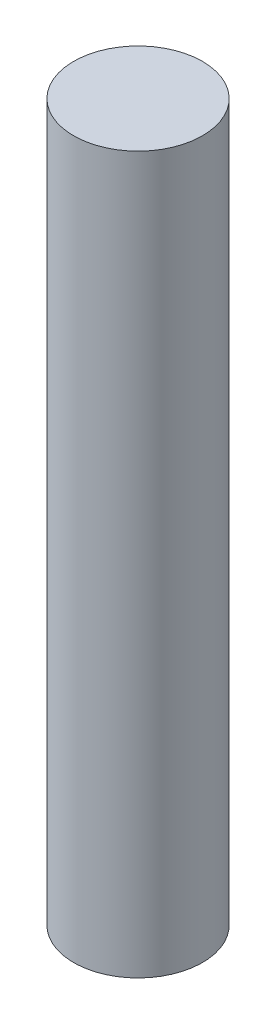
from build123d import *

# Parameters (mm, degrees)
SKETCH1_W = 4.5
SKETCH1_H = 50


with BuildPart() as part:
    # Sketch1 → Revolve1 (revolve)
    with BuildSketch(Plane.XY, mode=Mode.PRIVATE) as revolve1_sk:
        with Locations((2.25, 25)):
            Rectangle(SKETCH1_W, SKETCH1_H)
    revolve(revolve1_sk.sketch.rotate(Axis((0, 50, 0), (0, -1, 0)), 270), axis=Axis((0, 50, 0), (0, -1, 0)))


solid = part.part
